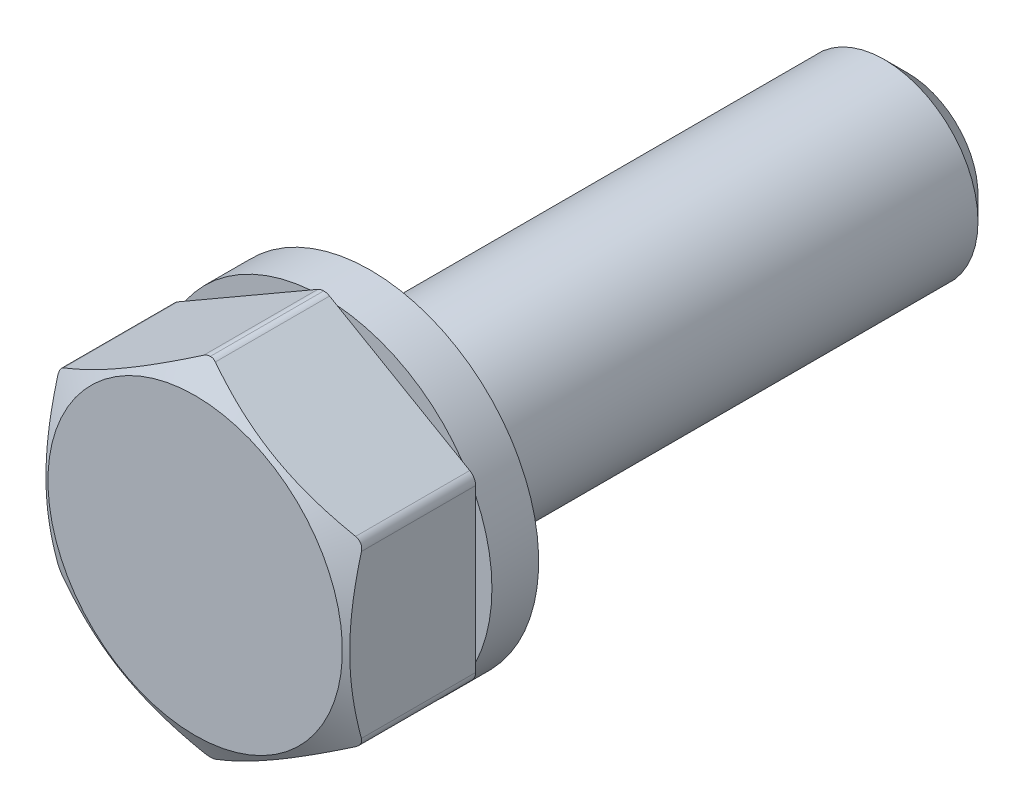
ISO-10303-21;
HEADER;
FILE_DESCRIPTION(('STEP AP214'),'2;1');
FILE_NAME('part.step','',(''),(''),'','','');
FILE_SCHEMA(('AUTOMOTIVE_DESIGN { 1 0 10303 214 1 1 1 1 }'));
ENDSEC;
DATA;
#1=APPLICATION_CONTEXT('core data for automotive mechanical design processes');
#2=APPLICATION_PROTOCOL_DEFINITION('international standard','automotive_design',2000,#1);
#3=PRODUCT_CONTEXT('',#1,'mechanical');
#4=PRODUCT('Part','Part','',(#3));
#5=PRODUCT_RELATED_PRODUCT_CATEGORY('part','',(#4));
#6=PRODUCT_DEFINITION_FORMATION('','',#4);
#7=PRODUCT_DEFINITION_CONTEXT('part definition',#1,'design');
#8=PRODUCT_DEFINITION('design','',#6,#7);
#9=PRODUCT_DEFINITION_SHAPE('','',#8);
#10=(LENGTH_UNIT() NAMED_UNIT(*) SI_UNIT(.MILLI.,.METRE.));
#11=(NAMED_UNIT(*) PLANE_ANGLE_UNIT() SI_UNIT($,.RADIAN.));
#12=(NAMED_UNIT(*) SI_UNIT($,.STERADIAN.) SOLID_ANGLE_UNIT());
#13=UNCERTAINTY_MEASURE_WITH_UNIT(LENGTH_MEASURE(1.E-05),#10,'distance_accuracy_value','');
#14=(GEOMETRIC_REPRESENTATION_CONTEXT(3) GLOBAL_UNCERTAINTY_ASSIGNED_CONTEXT((#13)) GLOBAL_UNIT_ASSIGNED_CONTEXT((#10,
#11,#12)) REPRESENTATION_CONTEXT('',''));
#15=CARTESIAN_POINT('',(0.,0.,0.));
#16=DIRECTION('',(0.,0.,1.));
#17=DIRECTION('',(1.,0.,0.));
#18=AXIS2_PLACEMENT_3D('',#15,#16,#17);
#19=CARTESIAN_POINT('',(0.,-6.92820323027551,2.));
#20=DIRECTION('',(0.,0.,1.));
#21=DIRECTION('',(-1.,0.,0.));
#22=AXIS2_PLACEMENT_3D('',#19,#20,#21);
#23=PLANE('',#22);
#24=CARTESIAN_POINT('',(0.,0.,2.));
#25=DIRECTION('',(0.,0.,1.));
#26=DIRECTION('',(0.,-1.,0.));
#27=AXIS2_PLACEMENT_3D('',#24,#25,#26);
#28=CIRCLE('',#27,7.2);
#29=CARTESIAN_POINT('',(-5.93188366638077,-4.08077886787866,2.));
#30=VERTEX_POINT('',#29);
#31=CARTESIAN_POINT('',(-6.5,-3.0967725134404,2.));
#32=VERTEX_POINT('',#31);
#33=EDGE_CURVE('E22',#30,#32,#28,.F.);
#34=ORIENTED_EDGE('',*,*,#33,.F.);
#35=DIRECTION('',(-0.866025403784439,0.5,0.));
#36=VECTOR('',#35,1.);
#37=CARTESIAN_POINT('',(-0.25,-7.36121593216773,2.));
#38=LINE('',#37,#36);
#39=CARTESIAN_POINT('',(-6.25,-3.89711431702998,2.));
#40=VERTEX_POINT('',#39);
#41=EDGE_CURVE('E168',#30,#40,#38,.T.);
#42=ORIENTED_EDGE('',*,*,#41,.T.);
#43=CARTESIAN_POINT('',(-6.,-3.46410161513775,2.));
#44=DIRECTION('',(0.,0.,-1.));
#45=DIRECTION('',(0.,-1.,0.));
#46=AXIS2_PLACEMENT_3D('',#43,#44,#45);
#47=CIRCLE('',#46,0.5);
#48=CARTESIAN_POINT('',(-6.5,-3.46410161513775,2.));
#49=VERTEX_POINT('',#48);
#50=EDGE_CURVE('E275',#40,#49,#47,.T.);
#51=ORIENTED_EDGE('',*,*,#50,.T.);
#52=DIRECTION('',(0.,1.,0.));
#53=VECTOR('',#52,1.);
#54=CARTESIAN_POINT('',(-6.5,-3.46410161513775,2.));
#55=LINE('',#54,#53);
#56=EDGE_CURVE('E271',#49,#32,#55,.T.);
#57=ORIENTED_EDGE('',*,*,#56,.T.);
#58=EDGE_LOOP('',(#34,#42,#51,#57));
#59=FACE_BOUND('',#58,.T.);
#60=ADVANCED_FACE('F14',(#59),#23,.F.);
#61=CARTESIAN_POINT('',(-6.5,3.0967725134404,2.));
#62=VERTEX_POINT('',#61);
#63=CARTESIAN_POINT('',(-5.93188366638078,4.08077886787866,2.));
#64=VERTEX_POINT('',#63);
#65=EDGE_CURVE('E195',#62,#64,#28,.F.);
#66=ORIENTED_EDGE('',*,*,#65,.F.);
#67=CARTESIAN_POINT('',(-6.5,3.46410161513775,2.));
#68=VERTEX_POINT('',#67);
#69=EDGE_CURVE('E269',#62,#68,#55,.T.);
#70=ORIENTED_EDGE('',*,*,#69,.T.);
#71=CARTESIAN_POINT('',(-6.,3.46410161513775,2.));
#72=DIRECTION('',(0.,0.,-1.));
#73=DIRECTION('',(0.,-1.,0.));
#74=AXIS2_PLACEMENT_3D('',#71,#72,#73);
#75=CIRCLE('',#74,0.5);
#76=CARTESIAN_POINT('',(-6.25,3.89711431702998,2.));
#77=VERTEX_POINT('',#76);
#78=EDGE_CURVE('E265',#68,#77,#75,.T.);
#79=ORIENTED_EDGE('',*,*,#78,.T.);
#80=DIRECTION('',(0.866025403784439,0.5,0.));
#81=VECTOR('',#80,1.);
#82=CARTESIAN_POINT('',(-6.25,3.89711431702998,2.));
#83=LINE('',#82,#81);
#84=EDGE_CURVE('E270',#77,#64,#83,.T.);
#85=ORIENTED_EDGE('',*,*,#84,.T.);
#86=EDGE_LOOP('',(#66,#70,#79,#85));
#87=FACE_BOUND('',#86,.T.);
#88=ADVANCED_FACE('F338',(#87),#23,.F.);
#89=CARTESIAN_POINT('',(-0.568116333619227,7.17755138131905,2.));
#90=VERTEX_POINT('',#89);
#91=CARTESIAN_POINT('',(0.56811633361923,7.17755138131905,2.));
#92=VERTEX_POINT('',#91);
#93=EDGE_CURVE('E198',#90,#92,#28,.F.);
#94=ORIENTED_EDGE('',*,*,#93,.F.);
#95=CARTESIAN_POINT('',(-0.249999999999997,7.36121593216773,2.));
#96=VERTEX_POINT('',#95);
#97=EDGE_CURVE('E285',#90,#96,#83,.T.);
#98=ORIENTED_EDGE('',*,*,#97,.T.);
#99=CARTESIAN_POINT('',(0.,6.92820323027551,2.));
#100=DIRECTION('',(0.,0.,-1.));
#101=DIRECTION('',(0.,1.,0.));
#102=AXIS2_PLACEMENT_3D('',#99,#100,#101);
#103=CIRCLE('',#102,0.5);
#104=CARTESIAN_POINT('',(0.,7.42820323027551,2.));
#105=VERTEX_POINT('',#104);
#106=EDGE_CURVE('E241',#96,#105,#103,.T.);
#107=ORIENTED_EDGE('',*,*,#106,.T.);
#108=CARTESIAN_POINT('',(0.,6.92820323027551,2.));
#109=DIRECTION('',(0.,0.,-1.));
#110=DIRECTION('',(0.,1.,0.));
#111=AXIS2_PLACEMENT_3D('',#108,#109,#110);
#112=CIRCLE('',#111,0.5);
#113=CARTESIAN_POINT('',(0.25,7.36121593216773,2.));
#114=VERTEX_POINT('',#113);
#115=EDGE_CURVE('E238',#105,#114,#112,.T.);
#116=ORIENTED_EDGE('',*,*,#115,.T.);
#117=DIRECTION('',(0.866025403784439,-0.5,0.));
#118=VECTOR('',#117,1.);
#119=CARTESIAN_POINT('',(0.25,7.36121593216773,2.));
#120=LINE('',#119,#118);
#121=EDGE_CURVE('E230',#114,#92,#120,.T.);
#122=ORIENTED_EDGE('',*,*,#121,.T.);
#123=EDGE_LOOP('',(#94,#98,#107,#116,#122));
#124=FACE_BOUND('',#123,.T.);
#125=ADVANCED_FACE('F345',(#124),#23,.F.);
#126=CARTESIAN_POINT('',(5.93188366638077,4.08077886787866,2.));
#127=VERTEX_POINT('',#126);
#128=CARTESIAN_POINT('',(6.5,3.0967725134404,2.));
#129=VERTEX_POINT('',#128);
#130=EDGE_CURVE('E191',#127,#129,#28,.F.);
#131=ORIENTED_EDGE('',*,*,#130,.F.);
#132=CARTESIAN_POINT('',(6.25,3.89711431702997,2.));
#133=VERTEX_POINT('',#132);
#134=EDGE_CURVE('E212',#127,#133,#120,.T.);
#135=ORIENTED_EDGE('',*,*,#134,.T.);
#136=CARTESIAN_POINT('',(6.,3.46410161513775,2.));
#137=DIRECTION('',(0.,0.,-1.));
#138=DIRECTION('',(0.,-1.,0.));
#139=AXIS2_PLACEMENT_3D('',#136,#137,#138);
#140=CIRCLE('',#139,0.5);
#141=CARTESIAN_POINT('',(6.5,3.46410161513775,2.));
#142=VERTEX_POINT('',#141);
#143=EDGE_CURVE('E228',#133,#142,#140,.T.);
#144=ORIENTED_EDGE('',*,*,#143,.T.);
#145=DIRECTION('',(0.,-1.,0.));
#146=VECTOR('',#145,1.);
#147=CARTESIAN_POINT('',(6.5,3.46410161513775,2.));
#148=LINE('',#147,#146);
#149=EDGE_CURVE('E215',#142,#129,#148,.T.);
#150=ORIENTED_EDGE('',*,*,#149,.T.);
#151=EDGE_LOOP('',(#131,#135,#144,#150));
#152=FACE_BOUND('',#151,.T.);
#153=ADVANCED_FACE('F210',(#152),#23,.F.);
#154=CARTESIAN_POINT('',(6.5,-3.0967725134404,2.));
#155=VERTEX_POINT('',#154);
#156=CARTESIAN_POINT('',(5.93188366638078,-4.08077886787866,2.));
#157=VERTEX_POINT('',#156);
#158=EDGE_CURVE('E189',#155,#157,#28,.F.);
#159=ORIENTED_EDGE('',*,*,#158,.F.);
#160=CARTESIAN_POINT('',(6.5,-3.46410161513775,2.));
#161=VERTEX_POINT('',#160);
#162=EDGE_CURVE('E280',#155,#161,#148,.T.);
#163=ORIENTED_EDGE('',*,*,#162,.T.);
#164=CARTESIAN_POINT('',(6.,-3.46410161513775,2.));
#165=DIRECTION('',(0.,0.,-1.));
#166=DIRECTION('',(0.,-1.,0.));
#167=AXIS2_PLACEMENT_3D('',#164,#165,#166);
#168=CIRCLE('',#167,0.5);
#169=CARTESIAN_POINT('',(6.25,-3.89711431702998,2.));
#170=VERTEX_POINT('',#169);
#171=EDGE_CURVE('E314',#161,#170,#168,.T.);
#172=ORIENTED_EDGE('',*,*,#171,.T.);
#173=DIRECTION('',(-0.866025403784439,-0.5,0.));
#174=VECTOR('',#173,1.);
#175=CARTESIAN_POINT('',(6.25,-3.89711431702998,2.));
#176=LINE('',#175,#174);
#177=EDGE_CURVE('E318',#170,#157,#176,.T.);
#178=ORIENTED_EDGE('',*,*,#177,.T.);
#179=EDGE_LOOP('',(#159,#163,#172,#178));
#180=FACE_BOUND('',#179,.T.);
#181=ADVANCED_FACE('F351',(#180),#23,.F.);
#182=CARTESIAN_POINT('',(0.,6.92820323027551,7.5));
#183=DIRECTION('',(0.,0.,-1.));
#184=DIRECTION('',(0.,1.,0.));
#185=AXIS2_PLACEMENT_3D('',#182,#183,#184);
#186=CYLINDRICAL_SURFACE('',#185,0.5);
#187=DIRECTION('',(0.,0.,-1.));
#188=VECTOR('',#187,1.);
#189=CARTESIAN_POINT('',(-0.249999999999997,7.36121593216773,7.5));
#190=LINE('',#189,#188);
#191=CARTESIAN_POINT('',(-0.249999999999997,7.36121593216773,6.88485642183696));
#192=VERTEX_POINT('',#191);
#193=EDGE_CURVE('E259',#192,#96,#190,.T.);
#194=ORIENTED_EDGE('',*,*,#193,.F.);
#195=CARTESIAN_POINT('',(-0.250199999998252,7.36110040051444,6.88491916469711));
#196=CARTESIAN_POINT('',(-0.228543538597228,7.37365394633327,6.87810237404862));
#197=CARTESIAN_POINT('',(-0.205681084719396,7.38466007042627,6.87214077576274));
#198=CARTESIAN_POINT('',(-0.158776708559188,7.40296671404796,6.86223970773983));
#199=CARTESIAN_POINT('',(-0.134776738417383,7.41035049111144,6.85825477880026));
#200=CARTESIAN_POINT('',(-0.0923872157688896,7.41993602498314,6.8530851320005));
#201=CARTESIAN_POINT('',(-0.0742464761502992,7.42300088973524,6.85143364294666));
#202=CARTESIAN_POINT('',(-0.0373436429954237,7.4271599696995,6.84919332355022));
#203=CARTESIAN_POINT('',(-0.0185762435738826,7.42821766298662,6.84862418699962));
#204=CARTESIAN_POINT('',(0.000200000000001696,7.42820319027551,6.84863158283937));
#205=B_SPLINE_CURVE_WITH_KNOTS('',3,(#195,#196,#197,#198,#199,#200,#201,#202,#203,#204),
.UNSPECIFIED.,.F.,.F.,(4,2,2,2,4),(0.,0.0778021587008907,0.153720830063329,0.208997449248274,
0.265270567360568),.UNSPECIFIED.);
#206=CARTESIAN_POINT('',(0.,7.42820323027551,6.84863156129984));
#207=VERTEX_POINT('',#206);
#208=EDGE_CURVE('E765',#192,#207,#205,.T.);
#209=ORIENTED_EDGE('',*,*,#208,.T.);
#210=DIRECTION('',(0.,0.,-1.));
#211=VECTOR('',#210,1.);
#212=CARTESIAN_POINT('',(0.,7.42820323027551,7.5));
#213=LINE('',#212,#211);
#214=EDGE_CURVE('E256',#207,#105,#213,.T.);
#215=ORIENTED_EDGE('',*,*,#214,.T.);
#216=ORIENTED_EDGE('',*,*,#106,.F.);
#217=EDGE_LOOP('',(#194,#209,#215,#216));
#218=FACE_BOUND('',#217,.T.);
#219=ADVANCED_FACE('F363',(#218),#186,.T.);
#220=CARTESIAN_POINT('',(0.,-6.92820323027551,7.5));
#221=DIRECTION('',(0.,0.,-1.));
#222=DIRECTION('',(0.,1.,0.));
#223=AXIS2_PLACEMENT_3D('',#220,#221,#222);
#224=CYLINDRICAL_SURFACE('',#223,0.5);
#225=DIRECTION('',(0.,0.,-1.));
#226=VECTOR('',#225,1.);
#227=CARTESIAN_POINT('',(0.25,-7.36121593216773,7.5));
#228=LINE('',#227,#226);
#229=CARTESIAN_POINT('',(0.25,-7.36121593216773,6.88485642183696));
#230=VERTEX_POINT('',#229);
#231=CARTESIAN_POINT('',(0.25,-7.36121593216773,2.));
#232=VERTEX_POINT('',#231);
#233=EDGE_CURVE('E243',#230,#232,#228,.T.);
#234=ORIENTED_EDGE('',*,*,#233,.F.);
#235=CARTESIAN_POINT('',(0.250199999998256,-7.36110040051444,6.88491916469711));
#236=CARTESIAN_POINT('',(0.228805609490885,-7.37349856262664,6.87818675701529));
#237=CARTESIAN_POINT('',(0.206246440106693,-7.38438605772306,6.87228919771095));
#238=CARTESIAN_POINT('',(0.159385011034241,-7.40278010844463,6.86234040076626));
#239=CARTESIAN_POINT('',(0.135081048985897,-7.41028330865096,6.85829099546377));
#240=CARTESIAN_POINT('',(0.0853049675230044,-7.4215358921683,6.85222231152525));
#241=CARTESIAN_POINT('',(0.0598303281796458,-7.42527673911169,6.85020764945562));
#242=CARTESIAN_POINT('',(0.00855431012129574,-7.42878875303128,6.84831614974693));
#243=CARTESIAN_POINT('',(-0.0172467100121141,-7.42856395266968,6.84843714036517));
#244=CARTESIAN_POINT('',(-0.0675781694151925,-7.42423870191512,6.85076680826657));
#245=CARTESIAN_POINT('',(-0.0921227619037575,-7.42026335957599,6.85290809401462));
#246=CARTESIAN_POINT('',(-0.140133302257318,-7.40879777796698,6.85909282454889));
#247=CARTESIAN_POINT('',(-0.163599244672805,-7.40130752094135,6.863136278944));
#248=CARTESIAN_POINT('',(-0.19733314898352,-7.38777242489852,6.87045794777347));
#249=CARTESIAN_POINT('',(-0.208246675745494,-7.38292818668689,6.87308039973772));
#250=CARTESIAN_POINT('',(-0.229588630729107,-7.37253347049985,6.87871365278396));
#251=CARTESIAN_POINT('',(-0.240018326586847,-7.36698499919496,6.88172335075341));
#252=CARTESIAN_POINT('',(-0.250199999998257,-7.36110040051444,6.88491916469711));
#253=B_SPLINE_CURVE_WITH_KNOTS('',3,(#235,#236,#237,#238,#239,#240,#241,#242,#243,#244,#245,
#246,#247,#248,#249,#250,#251,#252),.UNSPECIFIED.,.F.,.F.,(4,2,2,2,2,2,2,2,4),(0.,
0.0768357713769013,0.153747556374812,0.230833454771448,0.307840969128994,0.382367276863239,
0.456893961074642,0.493538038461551,0.530079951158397),.UNSPECIFIED.);
#254=CARTESIAN_POINT('',(-0.25,-7.36121593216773,6.88485642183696));
#255=VERTEX_POINT('',#254);
#256=EDGE_CURVE('E758',#230,#255,#253,.T.);
#257=ORIENTED_EDGE('',*,*,#256,.T.);
#258=DIRECTION('',(0.,0.,-1.));
#259=VECTOR('',#258,1.);
#260=CARTESIAN_POINT('',(-0.25,-7.36121593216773,7.5));
#261=LINE('',#260,#259);
#262=CARTESIAN_POINT('',(-0.25,-7.36121593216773,2.));
#263=VERTEX_POINT('',#262);
#264=EDGE_CURVE('E247',#255,#263,#261,.T.);
#265=ORIENTED_EDGE('',*,*,#264,.T.);
#266=CARTESIAN_POINT('',(0.,-6.92820323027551,2.));
#267=DIRECTION('',(0.,0.,-1.));
#268=DIRECTION('',(0.,-1.,0.));
#269=AXIS2_PLACEMENT_3D('',#266,#267,#268);
#270=CIRCLE('',#269,0.5);
#271=EDGE_CURVE('E162',#232,#263,#270,.T.);
#272=ORIENTED_EDGE('',*,*,#271,.F.);
#273=EDGE_LOOP('',(#234,#257,#265,#272));
#274=FACE_BOUND('',#273,.T.);
#275=ADVANCED_FACE('F370',(#274),#224,.T.);
#276=CARTESIAN_POINT('',(6.25,-3.89711431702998,7.5));
#277=DIRECTION('',(0.5,-0.866025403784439,0.));
#278=DIRECTION('',(0.,0.,-1.));
#279=AXIS2_PLACEMENT_3D('',#276,#277,#278);
#280=PLANE('',#279);
#281=DIRECTION('',(0.,0.,-1.));
#282=VECTOR('',#281,1.);
#283=CARTESIAN_POINT('',(6.25,-3.89711431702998,7.5));
#284=LINE('',#283,#282);
#285=CARTESIAN_POINT('',(6.25,-3.89711431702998,6.88485642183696));
#286=VERTEX_POINT('',#285);
#287=EDGE_CURVE('E248',#286,#170,#284,.T.);
#288=ORIENTED_EDGE('',*,*,#287,.F.);
#289=CARTESIAN_POINT('',(6.2502,-3.89699884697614,6.88479371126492));
#290=CARTESIAN_POINT('',(6.10935352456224,-3.97831659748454,6.92895001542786));
#291=CARTESIAN_POINT('',(5.96798656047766,-4.05993485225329,6.97086073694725));
#292=CARTESIAN_POINT('',(5.68415119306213,-4.22380727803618,7.04960828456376));
#293=CARTESIAN_POINT('',(5.54168244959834,-4.30606164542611,7.08644347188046));
#294=CARTESIAN_POINT('',(5.11219808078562,-4.55402456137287,7.18853231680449));
#295=CARTESIAN_POINT('',(4.82356861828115,-4.72066485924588,7.2452196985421));
#296=CARTESIAN_POINT('',(4.39169797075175,-4.97000549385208,7.30923511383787));
#297=CARTESIAN_POINT('',(4.24957447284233,-5.05206053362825,7.32698098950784));
#298=CARTESIAN_POINT('',(3.96481200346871,-5.21646822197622,7.35555697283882));
#299=CARTESIAN_POINT('',(3.82217309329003,-5.29882083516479,7.36638787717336));
#300=CARTESIAN_POINT('',(3.53675560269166,-5.46360670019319,7.38086037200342));
#301=CARTESIAN_POINT('',(3.39397728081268,-5.54603980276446,7.38450873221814));
#302=CARTESIAN_POINT('',(3.10843035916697,-5.71090039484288,7.38455098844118));
#303=CARTESIAN_POINT('',(2.96566175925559,-5.79332788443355,7.38094521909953));
#304=CARTESIAN_POINT('',(2.6074016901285,-6.00016943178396,7.36287303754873));
#305=CARTESIAN_POINT('',(2.39207509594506,-6.12448829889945,7.34379383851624));
#306=CARTESIAN_POINT('',(1.96277674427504,-6.3723438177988,7.29023608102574));
#307=CARTESIAN_POINT('',(1.74880579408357,-6.49588000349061,7.25574908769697));
#308=CARTESIAN_POINT('',(1.31910945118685,-6.74396530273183,7.17230265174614));
#309=CARTESIAN_POINT('',(1.10342062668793,-6.86849330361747,7.12309652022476));
#310=CARTESIAN_POINT('',(0.674659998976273,-7.11603836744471,7.01254279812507));
#311=CARTESIAN_POINT('',(0.461585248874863,-7.23905713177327,6.95121053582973));
#312=CARTESIAN_POINT('',(0.2498,-7.36133140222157,6.88479371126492));
#313=B_SPLINE_CURVE_WITH_KNOTS('',3,(#289,#290,#291,#292,#293,#294,#295,#296,#297,#298,#299,
#300,#301,#302,#303,#304,#305,#306,#307,#308,#309,#310,#311,#312),.UNSPECIFIED.,.F.,.F.,(4,2,2,
2,2,2,2,2,2,2,2,4),(0.,0.505527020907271,1.01121688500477,2.02426346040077,2.51934622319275,
3.01437193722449,3.50893085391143,4.00346695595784,4.75102402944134,5.49899084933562,
6.26027182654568,7.02059657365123),.UNSPECIFIED.);
#314=EDGE_CURVE('E306',#286,#230,#313,.T.);
#315=ORIENTED_EDGE('',*,*,#314,.T.);
#316=ORIENTED_EDGE('',*,*,#233,.T.);
#317=CARTESIAN_POINT('',(0.568116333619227,-7.17755138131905,2.));
#318=VERTEX_POINT('',#317);
#319=EDGE_CURVE('E309',#318,#232,#176,.T.);
#320=ORIENTED_EDGE('',*,*,#319,.F.);
#321=EDGE_CURVE('E36',#157,#318,#176,.T.);
#322=ORIENTED_EDGE('',*,*,#321,.F.);
#323=ORIENTED_EDGE('',*,*,#177,.F.);
#324=EDGE_LOOP('',(#288,#315,#316,#320,#322,#323));
#325=FACE_BOUND('',#324,.T.);
#326=ADVANCED_FACE('F472',(#325),#280,.T.);
#327=CARTESIAN_POINT('',(6.,-3.46410161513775,7.5));
#328=DIRECTION('',(0.,0.,-1.));
#329=DIRECTION('',(0.,1.,0.));
#330=AXIS2_PLACEMENT_3D('',#327,#328,#329);
#331=CYLINDRICAL_SURFACE('',#330,0.5);
#332=DIRECTION('',(0.,0.,-1.));
#333=VECTOR('',#332,1.);
#334=CARTESIAN_POINT('',(6.5,-3.46410161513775,7.5));
#335=LINE('',#334,#333);
#336=CARTESIAN_POINT('',(6.5,-3.46410161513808,6.8848564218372));
#337=VERTEX_POINT('',#336);
#338=EDGE_CURVE('E249',#337,#161,#335,.T.);
#339=ORIENTED_EDGE('',*,*,#338,.F.);
#340=CARTESIAN_POINT('',(6.49999996,-3.46390161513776,6.88491074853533));
#341=CARTESIAN_POINT('',(6.50003835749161,-3.48862867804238,6.87817910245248));
#342=CARTESIAN_POINT('',(6.49818608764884,-3.513608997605,6.87228233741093));
#343=CARTESIAN_POINT('',(6.49068209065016,-3.56338843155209,6.8623351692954));
#344=CARTESIAN_POINT('',(6.48502660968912,-3.58818734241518,6.85828659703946));
#345=CARTESIAN_POINT('',(6.46988080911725,-3.63691962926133,6.85221958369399));
#346=CARTESIAN_POINT('',(6.46038183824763,-3.66085091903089,6.85020575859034));
#347=CARTESIAN_POINT('',(6.43778289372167,-3.70701140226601,6.84831589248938));
#348=CARTESIAN_POINT('',(6.4246865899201,-3.72924230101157,6.84843768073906));
#349=CARTESIAN_POINT('',(6.39577302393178,-3.77066597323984,6.85076885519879));
#350=CARTESIAN_POINT('',(6.38005699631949,-3.78993354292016,6.85291087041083));
#351=CARTESIAN_POINT('',(6.3461205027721,-3.82577695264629,6.85909699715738));
#352=CARTESIAN_POINT('',(6.32790002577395,-3.84235278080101,6.86314111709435));
#353=CARTESIAN_POINT('',(6.29931392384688,-3.86479511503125,6.87046281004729));
#354=CARTESIAN_POINT('',(6.28966534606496,-3.8718213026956,6.87308449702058));
#355=CARTESIAN_POINT('',(6.26999942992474,-3.8851010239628,6.87871591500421));
#356=CARTESIAN_POINT('',(6.25998319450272,-3.89135665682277,6.8817245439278));
#357=CARTESIAN_POINT('',(6.2498,-3.8972297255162,6.88491914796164));
#358=B_SPLINE_CURVE_WITH_KNOTS('',3,(#340,#341,#342,#343,#344,#345,#346,#347,#348,#349,#350,
#351,#352,#353,#354,#355,#356,#357),.UNSPECIFIED.,.F.,.F.,(4,2,2,2,2,2,2,2,4),(0.,
0.07683485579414,0.153745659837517,0.230830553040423,0.307837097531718,0.382363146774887,
0.456889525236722,0.493519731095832,0.530047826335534),.UNSPECIFIED.);
#359=EDGE_CURVE('E797',#337,#286,#358,.T.);
#360=ORIENTED_EDGE('',*,*,#359,.T.);
#361=ORIENTED_EDGE('',*,*,#287,.T.);
#362=ORIENTED_EDGE('',*,*,#171,.F.);
#363=EDGE_LOOP('',(#339,#360,#361,#362));
#364=FACE_BOUND('',#363,.T.);
#365=ADVANCED_FACE('F483',(#364),#331,.T.);
#366=CARTESIAN_POINT('',(6.5,3.46410161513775,7.5));
#367=DIRECTION('',(1.,0.,0.));
#368=DIRECTION('',(0.,1.,0.));
#369=AXIS2_PLACEMENT_3D('',#366,#367,#368);
#370=PLANE('',#369);
#371=DIRECTION('',(0.,0.,-1.));
#372=VECTOR('',#371,1.);
#373=CARTESIAN_POINT('',(6.5,3.46410161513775,7.5));
#374=LINE('',#373,#372);
#375=CARTESIAN_POINT('',(6.5,3.46410161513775,6.88485642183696));
#376=VERTEX_POINT('',#375);
#377=EDGE_CURVE('E253',#376,#142,#374,.T.);
#378=ORIENTED_EDGE('',*,*,#377,.F.);
#379=CARTESIAN_POINT('',(6.5,-9.87937316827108,4.30961762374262));
#380=CARTESIAN_POINT('',(6.5,-9.59455112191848,4.44695218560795));
#381=CARTESIAN_POINT('',(6.5,-9.30904728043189,4.58289879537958));
#382=CARTESIAN_POINT('',(6.5,-8.7363069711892,4.85122122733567));
#383=CARTESIAN_POINT('',(6.5,-8.44907020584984,4.98359641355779));
#384=CARTESIAN_POINT('',(6.5,-7.87090669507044,5.24469463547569));
#385=CARTESIAN_POINT('',(6.5,-7.57996819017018,5.37339172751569));
#386=CARTESIAN_POINT('',(6.5,-6.99567261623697,5.62515105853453));
#387=CARTESIAN_POINT('',(6.5,-6.70231567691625,5.74821359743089));
#388=CARTESIAN_POINT('',(6.5,-6.10941976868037,5.98852272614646));
#389=CARTESIAN_POINT('',(6.5,-5.80984832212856,6.10568963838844));
#390=CARTESIAN_POINT('',(6.5,-5.20714673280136,6.33066205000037));
#391=CARTESIAN_POINT('',(6.5,-4.90401619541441,6.43846649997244));
#392=CARTESIAN_POINT('',(6.5,-4.29435799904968,6.64176296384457));
#393=CARTESIAN_POINT('',(6.5,-3.9878393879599,6.73728181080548));
#394=CARTESIAN_POINT('',(6.5,-3.37045988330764,6.91285926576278));
#395=CARTESIAN_POINT('',(6.5,-3.05960041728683,6.99292283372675));
#396=CARTESIAN_POINT('',(6.5,-2.43324585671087,7.13365684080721));
#397=CARTESIAN_POINT('',(6.5,-2.11774866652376,7.19431821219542));
#398=CARTESIAN_POINT('',(6.5,-1.64178994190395,7.26767982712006));
#399=CARTESIAN_POINT('',(6.5,-1.48266496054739,7.28919686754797));
#400=CARTESIAN_POINT('',(6.5,-1.16369504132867,7.32592956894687));
#401=CARTESIAN_POINT('',(6.5,-1.0038501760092,7.34114585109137));
#402=CARTESIAN_POINT('',(6.5,-0.684627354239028,7.36487111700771));
#403=CARTESIAN_POINT('',(6.5,-0.525252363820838,7.37341985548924));
#404=CARTESIAN_POINT('',(6.5,-0.206284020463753,7.38376610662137));
#405=CARTESIAN_POINT('',(6.5,-0.0466906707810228,7.38556371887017));
#406=CARTESIAN_POINT('',(6.5,0.272385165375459,7.38236514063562));
#407=CARTESIAN_POINT('',(6.5,0.431867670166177,7.3773707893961));
#408=CARTESIAN_POINT('',(6.5,0.750486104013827,7.36071023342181));
#409=CARTESIAN_POINT('',(6.5,0.90962201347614,7.34904366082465));
#410=CARTESIAN_POINT('',(6.5,1.29759215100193,7.31270747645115));
#411=CARTESIAN_POINT('',(6.5,1.52610755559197,7.28456838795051));
#412=CARTESIAN_POINT('',(6.5,1.98129829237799,7.21611644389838));
#413=CARTESIAN_POINT('',(6.5,2.20797333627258,7.17580171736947));
#414=CARTESIAN_POINT('',(6.5,2.88565812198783,7.03862194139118));
#415=CARTESIAN_POINT('',(6.5,3.3334356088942,6.92561532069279));
#416=CARTESIAN_POINT('',(6.5,4.00309005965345,6.73138861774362));
#417=CARTESIAN_POINT('',(6.5,4.22848110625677,6.66160195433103));
#418=CARTESIAN_POINT('',(6.5,4.67708584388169,6.51522557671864));
#419=CARTESIAN_POINT('',(6.5,4.90029933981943,6.43863525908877));
#420=CARTESIAN_POINT('',(6.5,5.34343286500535,6.28028089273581));
#421=CARTESIAN_POINT('',(6.5,5.56336440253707,6.19854872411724));
#422=CARTESIAN_POINT('',(6.5,6.00136716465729,6.03045176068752));
#423=CARTESIAN_POINT('',(6.5,6.21943899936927,5.94408855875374));
#424=CARTESIAN_POINT('',(6.5,6.43672965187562,5.8558457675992));
#425=B_SPLINE_CURVE_WITH_KNOTS('',3,(#379,#380,#381,#382,#383,#384,#385,#386,#387,#388,#389,
#390,#391,#392,#393,#394,#395,#396,#397,#398,#399,#400,#401,#402,#403,#404,#405,#406,#407,#408,
#409,#410,#411,#412,#413,#414,#415,#416,#417,#418,#419,#420,#421,#422,#423,#424),.UNSPECIFIED.,
.F.,.F.,(4,2,2,2,2,2,2,2,2,2,2,2,2,2,2,2,2,2,2,2,2,2,4),(0.,0.948622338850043,1.89741249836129,
2.85176190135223,3.80606044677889,4.77094701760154,5.73594159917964,6.69879138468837,
7.66133165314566,8.62432111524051,9.1059354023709,9.58750219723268,10.0661752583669,
10.5448412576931,11.0233776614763,11.5019404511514,12.1922707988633,12.882707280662,
14.266258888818,14.9740490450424,15.6819020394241,16.3857318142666,17.089321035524),.UNSPECIFIED.);
#426=EDGE_CURVE('E791',#376,#337,#425,.F.);
#427=ORIENTED_EDGE('',*,*,#426,.T.);
#428=ORIENTED_EDGE('',*,*,#338,.T.);
#429=ORIENTED_EDGE('',*,*,#162,.F.);
#430=EDGE_CURVE('E279',#129,#155,#148,.T.);
#431=ORIENTED_EDGE('',*,*,#430,.F.);
#432=ORIENTED_EDGE('',*,*,#149,.F.);
#433=EDGE_LOOP('',(#378,#427,#428,#429,#431,#432));
#434=FACE_BOUND('',#433,.T.);
#435=ADVANCED_FACE('F377',(#434),#370,.T.);
#436=CARTESIAN_POINT('',(6.,3.46410161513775,7.5));
#437=DIRECTION('',(0.,0.,-1.));
#438=DIRECTION('',(0.,1.,0.));
#439=AXIS2_PLACEMENT_3D('',#436,#437,#438);
#440=CYLINDRICAL_SURFACE('',#439,0.5);
#441=DIRECTION('',(0.,0.,-1.));
#442=VECTOR('',#441,1.);
#443=CARTESIAN_POINT('',(6.25,3.89711431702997,7.5));
#444=LINE('',#443,#442);
#445=CARTESIAN_POINT('',(6.25,3.89711431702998,6.88485642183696));
#446=VERTEX_POINT('',#445);
#447=EDGE_CURVE('E225',#446,#133,#444,.T.);
#448=ORIENTED_EDGE('',*,*,#447,.F.);
#449=CARTESIAN_POINT('',(6.2498,3.8972297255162,6.88491914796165));
#450=CARTESIAN_POINT('',(6.27123431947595,3.8849007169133,6.87818674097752));
#451=CARTESIAN_POINT('',(6.29194275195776,3.87080764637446,6.87228918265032));
#452=CARTESIAN_POINT('',(6.33130317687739,3.83942147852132,6.86234038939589));
#453=CARTESIAN_POINT('',(6.3499531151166,3.82212522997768,6.8582909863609));
#454=CARTESIAN_POINT('',(6.38458616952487,3.7846441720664,6.85222230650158));
#455=CARTESIAN_POINT('',(6.40056315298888,3.76445291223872,6.8502076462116));
#456=CARTESIAN_POINT('',(6.4292426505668,3.72180258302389,6.84831614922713));
#457=CARTESIAN_POINT('',(6.44194847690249,3.69934583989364,6.84843714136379));
#458=CARTESIAN_POINT('',(6.4633684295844,3.65359487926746,6.85076681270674));
#459=CARTESIAN_POINT('',(6.47219797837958,3.6303509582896,6.85290810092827));
#460=CARTESIAN_POINT('',(6.48627375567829,3.58303981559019,6.85909283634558));
#461=CARTESIAN_POINT('',(6.49151996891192,3.55897259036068,6.86313629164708));
#462=CARTESIAN_POINT('',(6.49666443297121,3.52299585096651,6.87045689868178));
#463=CARTESIAN_POINT('',(6.49792559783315,3.51112756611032,6.87307810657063));
#464=CARTESIAN_POINT('',(6.49959449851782,3.48745790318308,6.8787085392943));
#465=CARTESIAN_POINT('',(6.50000460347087,3.47565643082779,6.88171666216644));
#466=CARTESIAN_POINT('',(6.49999996,3.46390161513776,6.88491074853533));
#467=B_SPLINE_CURVE_WITH_KNOTS('',3,(#449,#450,#451,#452,#453,#454,#455,#456,#457,#458,#459,
#460,#461,#462,#463,#464,#465,#466),.UNSPECIFIED.,.F.,.F.,(4,2,2,2,2,2,2,2,4),(0.,
0.0768357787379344,0.153747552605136,0.230833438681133,0.307840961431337,0.382367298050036,
0.456893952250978,0.493521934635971,0.530047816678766),.UNSPECIFIED.);
#468=EDGE_CURVE('E785',#446,#376,#467,.T.);
#469=ORIENTED_EDGE('',*,*,#468,.T.);
#470=ORIENTED_EDGE('',*,*,#377,.T.);
#471=ORIENTED_EDGE('',*,*,#143,.F.);
#472=EDGE_LOOP('',(#448,#469,#470,#471));
#473=FACE_BOUND('',#472,.T.);
#474=ADVANCED_FACE('F502',(#473),#440,.T.);
#475=CARTESIAN_POINT('',(0.25,7.36121593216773,7.5));
#476=DIRECTION('',(0.5,0.866025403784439,0.));
#477=DIRECTION('',(0.,0.,1.));
#478=AXIS2_PLACEMENT_3D('',#475,#476,#477);
#479=PLANE('',#478);
#480=DIRECTION('',(0.,0.,-1.));
#481=VECTOR('',#480,1.);
#482=CARTESIAN_POINT('',(0.25,7.36121593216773,7.5));
#483=LINE('',#482,#481);
#484=CARTESIAN_POINT('',(0.25,7.36121593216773,6.88485642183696));
#485=VERTEX_POINT('',#484);
#486=EDGE_CURVE('E263',#485,#114,#483,.T.);
#487=ORIENTED_EDGE('',*,*,#486,.F.);
#488=CARTESIAN_POINT('',(0.2498,7.36133140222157,6.88479371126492));
#489=CARTESIAN_POINT('',(0.390646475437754,7.28001365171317,6.92895001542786));
#490=CARTESIAN_POINT('',(0.532013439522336,7.19839539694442,6.97086073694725));
#491=CARTESIAN_POINT('',(0.81584880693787,7.03452297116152,7.04960828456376));
#492=CARTESIAN_POINT('',(0.95831755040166,6.9522686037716,7.08644347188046));
#493=CARTESIAN_POINT('',(1.38780191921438,6.70430568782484,7.18853231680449));
#494=CARTESIAN_POINT('',(1.67643138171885,6.53766538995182,7.2452196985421));
#495=CARTESIAN_POINT('',(2.10830202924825,6.28832475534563,7.30923511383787));
#496=CARTESIAN_POINT('',(2.25042552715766,6.20626971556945,7.32698098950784));
#497=CARTESIAN_POINT('',(2.53518799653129,6.04186202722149,7.35555697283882));
#498=CARTESIAN_POINT('',(2.67782690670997,5.95950941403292,7.36638787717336));
#499=CARTESIAN_POINT('',(2.96324439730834,5.79472354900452,7.38086037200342));
#500=CARTESIAN_POINT('',(3.10602271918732,5.71229044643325,7.38450873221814));
#501=CARTESIAN_POINT('',(3.39156964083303,5.54742985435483,7.38455098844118));
#502=CARTESIAN_POINT('',(3.53433824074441,5.46500236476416,7.38094521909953));
#503=CARTESIAN_POINT('',(3.8925983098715,5.25816081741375,7.36287303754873));
#504=CARTESIAN_POINT('',(4.10792490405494,5.13384195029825,7.34379383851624));
#505=CARTESIAN_POINT('',(4.53722325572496,4.8859864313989,7.29023608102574));
#506=CARTESIAN_POINT('',(4.75119420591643,4.7624502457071,7.25574908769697));
#507=CARTESIAN_POINT('',(5.18089054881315,4.51436494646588,7.17230265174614));
#508=CARTESIAN_POINT('',(5.39657937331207,4.38983694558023,7.12309652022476));
#509=CARTESIAN_POINT('',(5.82534000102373,4.14229188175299,7.01254279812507));
#510=CARTESIAN_POINT('',(6.03841475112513,4.01927311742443,6.95121053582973));
#511=CARTESIAN_POINT('',(6.2502,3.89699884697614,6.88479371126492));
#512=B_SPLINE_CURVE_WITH_KNOTS('',3,(#488,#489,#490,#491,#492,#493,#494,#495,#496,#497,#498,
#499,#500,#501,#502,#503,#504,#505,#506,#507,#508,#509,#510,#511),.UNSPECIFIED.,.F.,.F.,(4,2,2,
2,2,2,2,2,2,2,2,4),(0.,0.505527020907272,1.01121688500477,2.02426346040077,2.51934622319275,
3.01437193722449,3.50893085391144,4.00346695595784,4.75102402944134,5.49899084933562,
6.26027182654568,7.02059657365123),.UNSPECIFIED.);
#513=EDGE_CURVE('E778',#485,#446,#512,.T.);
#514=ORIENTED_EDGE('',*,*,#513,.T.);
#515=ORIENTED_EDGE('',*,*,#447,.T.);
#516=ORIENTED_EDGE('',*,*,#134,.F.);
#517=EDGE_CURVE('E221',#92,#127,#120,.T.);
#518=ORIENTED_EDGE('',*,*,#517,.F.);
#519=ORIENTED_EDGE('',*,*,#121,.F.);
#520=EDGE_LOOP('',(#487,#514,#515,#516,#518,#519));
#521=FACE_BOUND('',#520,.T.);
#522=ADVANCED_FACE('F219',(#521),#479,.T.);
#523=CARTESIAN_POINT('',(0.,6.92820323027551,7.5));
#524=DIRECTION('',(0.,0.,-1.));
#525=DIRECTION('',(0.,1.,0.));
#526=AXIS2_PLACEMENT_3D('',#523,#524,#525);
#527=CYLINDRICAL_SURFACE('',#526,0.5);
#528=ORIENTED_EDGE('',*,*,#214,.F.);
#529=CARTESIAN_POINT('',(-0.000199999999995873,7.42820319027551,6.84863158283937));
#530=CARTESIAN_POINT('',(0.0257483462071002,7.42824939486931,6.84860823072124));
#531=CARTESIAN_POINT('',(0.051681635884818,7.42620622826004,6.84970690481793));
#532=CARTESIAN_POINT('',(0.102147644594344,7.41829810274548,6.8539677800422));
#533=CARTESIAN_POINT('',(0.126699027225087,7.41252573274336,6.85707999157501));
#534=CARTESIAN_POINT('',(0.167901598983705,7.39952419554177,6.86410184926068));
#535=CARTESIAN_POINT('',(0.184893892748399,7.39311100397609,6.86756831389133));
#536=CARTESIAN_POINT('',(0.218203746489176,7.37845249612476,6.87550407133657));
#537=CARTESIAN_POINT('',(0.234503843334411,7.37017651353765,6.87999016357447));
#538=CARTESIAN_POINT('',(0.250199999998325,7.36110040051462,6.88491916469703));
#539=B_SPLINE_CURVE_WITH_KNOTS('',3,(#529,#530,#531,#532,#533,#534,#535,#536,#537,#538),
.UNSPECIFIED.,.F.,.F.,(4,2,2,2,4),(0.,0.0777193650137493,0.153579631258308,0.208927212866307,
0.265262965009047),.UNSPECIFIED.);
#540=EDGE_CURVE('E697',#207,#485,#539,.T.);
#541=ORIENTED_EDGE('',*,*,#540,.T.);
#542=ORIENTED_EDGE('',*,*,#486,.T.);
#543=ORIENTED_EDGE('',*,*,#115,.F.);
#544=EDGE_LOOP('',(#528,#541,#542,#543));
#545=FACE_BOUND('',#544,.T.);
#546=ADVANCED_FACE('F522',(#545),#527,.T.);
#547=CARTESIAN_POINT('',(-6.25,3.89711431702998,7.5));
#548=DIRECTION('',(-0.5,0.866025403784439,0.));
#549=DIRECTION('',(0.,0.,1.));
#550=AXIS2_PLACEMENT_3D('',#547,#548,#549);
#551=PLANE('',#550);
#552=DIRECTION('',(0.,0.,-1.));
#553=VECTOR('',#552,1.);
#554=CARTESIAN_POINT('',(-6.25,3.89711431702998,7.5));
#555=LINE('',#554,#553);
#556=CARTESIAN_POINT('',(-6.25,3.89711431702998,6.88485642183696));
#557=VERTEX_POINT('',#556);
#558=EDGE_CURVE('E264',#557,#77,#555,.T.);
#559=ORIENTED_EDGE('',*,*,#558,.F.);
#560=CARTESIAN_POINT('',(-6.2502,3.89699884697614,6.88479371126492));
#561=CARTESIAN_POINT('',(-6.10935352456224,3.97831659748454,6.92895001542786));
#562=CARTESIAN_POINT('',(-5.96798656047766,4.05993485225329,6.97086073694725));
#563=CARTESIAN_POINT('',(-5.68415119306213,4.22380727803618,7.04960828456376));
#564=CARTESIAN_POINT('',(-5.54168244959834,4.30606164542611,7.08644347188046));
#565=CARTESIAN_POINT('',(-5.11219808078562,4.55402456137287,7.18853231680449));
#566=CARTESIAN_POINT('',(-4.82356861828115,4.72066485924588,7.2452196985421));
#567=CARTESIAN_POINT('',(-4.39169797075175,4.97000549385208,7.30923511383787));
#568=CARTESIAN_POINT('',(-4.24957447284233,5.05206053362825,7.32698098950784));
#569=CARTESIAN_POINT('',(-3.96481200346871,5.21646822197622,7.35555697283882));
#570=CARTESIAN_POINT('',(-3.82217309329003,5.29882083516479,7.36638787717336));
#571=CARTESIAN_POINT('',(-3.53675560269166,5.46360670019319,7.38086037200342));
#572=CARTESIAN_POINT('',(-3.39397728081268,5.54603980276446,7.38450873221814));
#573=CARTESIAN_POINT('',(-3.10843035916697,5.71090039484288,7.38455098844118));
#574=CARTESIAN_POINT('',(-2.96566175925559,5.79332788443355,7.38094521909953));
#575=CARTESIAN_POINT('',(-2.6074016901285,6.00016943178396,7.36287303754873));
#576=CARTESIAN_POINT('',(-2.39207509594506,6.12448829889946,7.34379383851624));
#577=CARTESIAN_POINT('',(-1.96277674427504,6.37234381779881,7.29023608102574));
#578=CARTESIAN_POINT('',(-1.74880579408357,6.49588000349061,7.25574908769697));
#579=CARTESIAN_POINT('',(-1.31910945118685,6.74396530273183,7.17230265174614));
#580=CARTESIAN_POINT('',(-1.10342062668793,6.86849330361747,7.12309652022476));
#581=CARTESIAN_POINT('',(-0.674659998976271,7.11603836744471,7.01254279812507));
#582=CARTESIAN_POINT('',(-0.461585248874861,7.23905713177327,6.95121053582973));
#583=CARTESIAN_POINT('',(-0.249799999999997,7.36133140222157,6.88479371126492));
#584=B_SPLINE_CURVE_WITH_KNOTS('',3,(#560,#561,#562,#563,#564,#565,#566,#567,#568,#569,#570,
#571,#572,#573,#574,#575,#576,#577,#578,#579,#580,#581,#582,#583),.UNSPECIFIED.,.F.,.F.,(4,2,2,
2,2,2,2,2,2,2,2,4),(0.,0.505527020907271,1.01121688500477,2.02426346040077,2.51934622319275,
3.01437193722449,3.50893085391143,4.00346695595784,4.75102402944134,5.49899084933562,
6.26027182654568,7.02059657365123),.UNSPECIFIED.);
#585=EDGE_CURVE('E751',#557,#192,#584,.T.);
#586=ORIENTED_EDGE('',*,*,#585,.T.);
#587=ORIENTED_EDGE('',*,*,#193,.T.);
#588=ORIENTED_EDGE('',*,*,#97,.F.);
#589=EDGE_CURVE('E284',#64,#90,#83,.T.);
#590=ORIENTED_EDGE('',*,*,#589,.F.);
#591=ORIENTED_EDGE('',*,*,#84,.F.);
#592=EDGE_LOOP('',(#559,#586,#587,#588,#590,#591));
#593=FACE_BOUND('',#592,.T.);
#594=ADVANCED_FACE('F531',(#593),#551,.T.);
#595=CARTESIAN_POINT('',(-6.,3.46410161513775,7.5));
#596=DIRECTION('',(0.,0.,-1.));
#597=DIRECTION('',(0.,1.,0.));
#598=AXIS2_PLACEMENT_3D('',#595,#596,#597);
#599=CYLINDRICAL_SURFACE('',#598,0.5);
#600=DIRECTION('',(0.,0.,-1.));
#601=VECTOR('',#600,1.);
#602=CARTESIAN_POINT('',(-6.5,3.46410161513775,7.5));
#603=LINE('',#602,#601);
#604=CARTESIAN_POINT('',(-6.5,3.46410161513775,6.88485642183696));
#605=VERTEX_POINT('',#604);
#606=EDGE_CURVE('E289',#605,#68,#603,.T.);
#607=ORIENTED_EDGE('',*,*,#606,.F.);
#608=CARTESIAN_POINT('',(-6.49999996,3.46390161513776,6.88491074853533));
#609=CARTESIAN_POINT('',(-6.50003835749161,3.48862867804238,6.87817910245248));
#610=CARTESIAN_POINT('',(-6.49818608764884,3.513608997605,6.87228233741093));
#611=CARTESIAN_POINT('',(-6.49068209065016,3.56338843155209,6.8623351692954));
#612=CARTESIAN_POINT('',(-6.48502660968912,3.58818734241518,6.85828659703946));
#613=CARTESIAN_POINT('',(-6.46988080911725,3.63691962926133,6.85221958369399));
#614=CARTESIAN_POINT('',(-6.46038183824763,3.66085091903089,6.85020575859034));
#615=CARTESIAN_POINT('',(-6.43778289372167,3.70701140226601,6.84831589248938));
#616=CARTESIAN_POINT('',(-6.4246865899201,3.72924230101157,6.84843768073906));
#617=CARTESIAN_POINT('',(-6.39577302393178,3.77066597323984,6.85076885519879));
#618=CARTESIAN_POINT('',(-6.38005699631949,3.78993354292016,6.85291087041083));
#619=CARTESIAN_POINT('',(-6.3461205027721,3.82577695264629,6.85909699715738));
#620=CARTESIAN_POINT('',(-6.32790002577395,3.84235278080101,6.86314111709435));
#621=CARTESIAN_POINT('',(-6.29931392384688,3.86479511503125,6.87046281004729));
#622=CARTESIAN_POINT('',(-6.28966534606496,3.8718213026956,6.87308449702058));
#623=CARTESIAN_POINT('',(-6.26999942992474,3.8851010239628,6.87871591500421));
#624=CARTESIAN_POINT('',(-6.25998319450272,3.89135665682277,6.8817245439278));
#625=CARTESIAN_POINT('',(-6.2498,3.8972297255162,6.88491914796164));
#626=B_SPLINE_CURVE_WITH_KNOTS('',3,(#608,#609,#610,#611,#612,#613,#614,#615,#616,#617,#618,
#619,#620,#621,#622,#623,#624,#625),.UNSPECIFIED.,.F.,.F.,(4,2,2,2,2,2,2,2,4),(0.,
0.07683485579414,0.153745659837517,0.230830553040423,0.307837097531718,0.382363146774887,
0.456889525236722,0.493519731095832,0.530047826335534),.UNSPECIFIED.);
#627=EDGE_CURVE('E744',#605,#557,#626,.T.);
#628=ORIENTED_EDGE('',*,*,#627,.T.);
#629=ORIENTED_EDGE('',*,*,#558,.T.);
#630=ORIENTED_EDGE('',*,*,#78,.F.);
#631=EDGE_LOOP('',(#607,#628,#629,#630));
#632=FACE_BOUND('',#631,.T.);
#633=ADVANCED_FACE('F542',(#632),#599,.T.);
#634=CARTESIAN_POINT('',(-6.5,-3.46410161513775,7.5));
#635=DIRECTION('',(-1.,0.,0.));
#636=DIRECTION('',(0.,-1.,0.));
#637=AXIS2_PLACEMENT_3D('',#634,#635,#636);
#638=PLANE('',#637);
#639=DIRECTION('',(0.,0.,-1.));
#640=VECTOR('',#639,1.);
#641=CARTESIAN_POINT('',(-6.5,-3.46410161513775,7.5));
#642=LINE('',#641,#640);
#643=CARTESIAN_POINT('',(-6.5,-3.46410161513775,6.88485642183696));
#644=VERTEX_POINT('',#643);
#645=EDGE_CURVE('E286',#644,#49,#642,.T.);
#646=ORIENTED_EDGE('',*,*,#645,.F.);
#647=CARTESIAN_POINT('',(-6.5,-9.87937316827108,4.30961762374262));
#648=CARTESIAN_POINT('',(-6.5,-9.59455112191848,4.44695218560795));
#649=CARTESIAN_POINT('',(-6.5,-9.30904728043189,4.58289879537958));
#650=CARTESIAN_POINT('',(-6.5,-8.7363069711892,4.85122122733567));
#651=CARTESIAN_POINT('',(-6.5,-8.44907020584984,4.98359641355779));
#652=CARTESIAN_POINT('',(-6.5,-7.87090669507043,5.24469463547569));
#653=CARTESIAN_POINT('',(-6.5,-7.57996819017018,5.37339172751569));
#654=CARTESIAN_POINT('',(-6.5,-6.99567261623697,5.62515105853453));
#655=CARTESIAN_POINT('',(-6.5,-6.70231567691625,5.7482135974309));
#656=CARTESIAN_POINT('',(-6.5,-6.10941976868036,5.98852272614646));
#657=CARTESIAN_POINT('',(-6.5,-5.80984832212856,6.10568963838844));
#658=CARTESIAN_POINT('',(-6.5,-5.20714673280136,6.33066205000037));
#659=CARTESIAN_POINT('',(-6.5,-4.90401619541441,6.43846649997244));
#660=CARTESIAN_POINT('',(-6.5,-4.29435799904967,6.64176296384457));
#661=CARTESIAN_POINT('',(-6.5,-3.9878393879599,6.73728181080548));
#662=CARTESIAN_POINT('',(-6.5,-3.37045988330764,6.91285926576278));
#663=CARTESIAN_POINT('',(-6.5,-3.05960041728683,6.99292283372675));
#664=CARTESIAN_POINT('',(-6.5,-2.43324585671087,7.13365684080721));
#665=CARTESIAN_POINT('',(-6.5,-2.11774866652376,7.19431821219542));
#666=CARTESIAN_POINT('',(-6.5,-1.64178994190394,7.26767982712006));
#667=CARTESIAN_POINT('',(-6.5,-1.48266496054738,7.28919686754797));
#668=CARTESIAN_POINT('',(-6.5,-1.16369504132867,7.32592956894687));
#669=CARTESIAN_POINT('',(-6.5,-1.00385017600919,7.34114585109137));
#670=CARTESIAN_POINT('',(-6.5,-0.684627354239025,7.36487111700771));
#671=CARTESIAN_POINT('',(-6.5,-0.525252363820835,7.37341985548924));
#672=CARTESIAN_POINT('',(-6.5,-0.20628402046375,7.38376610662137));
#673=CARTESIAN_POINT('',(-6.5,-0.0466906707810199,7.38556371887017));
#674=CARTESIAN_POINT('',(-6.5,0.272385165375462,7.38236514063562));
#675=CARTESIAN_POINT('',(-6.5,0.43186767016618,7.3773707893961));
#676=CARTESIAN_POINT('',(-6.5,0.750486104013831,7.36071023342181));
#677=CARTESIAN_POINT('',(-6.5,0.909622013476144,7.34904366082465));
#678=CARTESIAN_POINT('',(-6.5,1.29759215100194,7.31270747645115));
#679=CARTESIAN_POINT('',(-6.5,1.52610755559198,7.28456838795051));
#680=CARTESIAN_POINT('',(-6.5,1.98129829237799,7.21611644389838));
#681=CARTESIAN_POINT('',(-6.5,2.20797333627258,7.17580171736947));
#682=CARTESIAN_POINT('',(-6.5,2.88565812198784,7.03862194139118));
#683=CARTESIAN_POINT('',(-6.5,3.33343560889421,6.92561532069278));
#684=CARTESIAN_POINT('',(-6.5,4.00309005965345,6.73138861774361));
#685=CARTESIAN_POINT('',(-6.5,4.22848110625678,6.66160195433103));
#686=CARTESIAN_POINT('',(-6.5,4.6770858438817,6.51522557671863));
#687=CARTESIAN_POINT('',(-6.5,4.90029933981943,6.43863525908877));
#688=CARTESIAN_POINT('',(-6.5,5.34343286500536,6.28028089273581));
#689=CARTESIAN_POINT('',(-6.5,5.56336440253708,6.19854872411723));
#690=CARTESIAN_POINT('',(-6.5,6.0013671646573,6.03045176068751));
#691=CARTESIAN_POINT('',(-6.5,6.21943899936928,5.94408855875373));
#692=CARTESIAN_POINT('',(-6.5,6.43672965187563,5.85584576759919));
#693=B_SPLINE_CURVE_WITH_KNOTS('',3,(#647,#648,#649,#650,#651,#652,#653,#654,#655,#656,#657,
#658,#659,#660,#661,#662,#663,#664,#665,#666,#667,#668,#669,#670,#671,#672,#673,#674,#675,#676,
#677,#678,#679,#680,#681,#682,#683,#684,#685,#686,#687,#688,#689,#690,#691,#692),.UNSPECIFIED.,
.F.,.F.,(4,2,2,2,2,2,2,2,2,2,2,2,2,2,2,2,2,2,2,2,2,2,4),(0.,0.948622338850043,1.89741249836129,
2.85176190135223,3.80606044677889,4.77094701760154,5.73594159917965,6.69879138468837,
7.66133165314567,8.62432111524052,9.10593540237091,9.58750219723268,10.0661752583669,
10.5448412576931,11.0233776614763,11.5019404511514,12.1922707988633,12.882707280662,
14.266258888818,14.9740490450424,15.6819020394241,16.3857318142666,17.089321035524),.UNSPECIFIED.);
#694=EDGE_CURVE('E737',#644,#605,#693,.T.);
#695=ORIENTED_EDGE('',*,*,#694,.T.);
#696=ORIENTED_EDGE('',*,*,#606,.T.);
#697=ORIENTED_EDGE('',*,*,#69,.F.);
#698=EDGE_CURVE('E276',#32,#62,#55,.T.);
#699=ORIENTED_EDGE('',*,*,#698,.F.);
#700=ORIENTED_EDGE('',*,*,#56,.F.);
#701=EDGE_LOOP('',(#646,#695,#696,#697,#699,#700));
#702=FACE_BOUND('',#701,.T.);
#703=ADVANCED_FACE('F553',(#702),#638,.T.);
#704=CARTESIAN_POINT('',(-6.,-3.46410161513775,7.5));
#705=DIRECTION('',(0.,0.,-1.));
#706=DIRECTION('',(0.,1.,0.));
#707=AXIS2_PLACEMENT_3D('',#704,#705,#706);
#708=CYLINDRICAL_SURFACE('',#707,0.5);
#709=DIRECTION('',(0.,0.,-1.));
#710=VECTOR('',#709,1.);
#711=CARTESIAN_POINT('',(-6.25,-3.89711431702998,7.5));
#712=LINE('',#711,#710);
#713=CARTESIAN_POINT('',(-6.25,-3.89711431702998,6.88485642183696));
#714=VERTEX_POINT('',#713);
#715=EDGE_CURVE('E290',#714,#40,#712,.T.);
#716=ORIENTED_EDGE('',*,*,#715,.F.);
#717=CARTESIAN_POINT('',(-6.2498,-3.8972297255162,6.88491914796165));
#718=CARTESIAN_POINT('',(-6.27123431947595,-3.8849007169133,6.87818674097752));
#719=CARTESIAN_POINT('',(-6.29194275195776,-3.87080764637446,6.87228918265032));
#720=CARTESIAN_POINT('',(-6.33130317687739,-3.83942147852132,6.86234038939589));
#721=CARTESIAN_POINT('',(-6.3499531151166,-3.82212522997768,6.8582909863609));
#722=CARTESIAN_POINT('',(-6.38458616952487,-3.7846441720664,6.85222230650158));
#723=CARTESIAN_POINT('',(-6.40056315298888,-3.76445291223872,6.8502076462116));
#724=CARTESIAN_POINT('',(-6.4292426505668,-3.72180258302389,6.84831614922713));
#725=CARTESIAN_POINT('',(-6.44194847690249,-3.69934583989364,6.84843714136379));
#726=CARTESIAN_POINT('',(-6.4633684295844,-3.65359487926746,6.85076681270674));
#727=CARTESIAN_POINT('',(-6.47219797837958,-3.6303509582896,6.85290810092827));
#728=CARTESIAN_POINT('',(-6.48627375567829,-3.58303981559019,6.85909283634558));
#729=CARTESIAN_POINT('',(-6.49151996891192,-3.55897259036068,6.86313629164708));
#730=CARTESIAN_POINT('',(-6.49666443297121,-3.52299585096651,6.87045689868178));
#731=CARTESIAN_POINT('',(-6.49792559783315,-3.51112756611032,6.87307810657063));
#732=CARTESIAN_POINT('',(-6.49959449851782,-3.48745790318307,6.8787085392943));
#733=CARTESIAN_POINT('',(-6.50000460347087,-3.47565643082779,6.88171666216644));
#734=CARTESIAN_POINT('',(-6.49999996,-3.46390161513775,6.88491074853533));
#735=B_SPLINE_CURVE_WITH_KNOTS('',3,(#717,#718,#719,#720,#721,#722,#723,#724,#725,#726,#727,
#728,#729,#730,#731,#732,#733,#734),.UNSPECIFIED.,.F.,.F.,(4,2,2,2,2,2,2,2,4),(0.,
0.0768357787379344,0.153747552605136,0.230833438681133,0.307840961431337,0.382367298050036,
0.456893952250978,0.493521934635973,0.530047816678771),.UNSPECIFIED.);
#736=EDGE_CURVE('E716',#714,#644,#735,.T.);
#737=ORIENTED_EDGE('',*,*,#736,.T.);
#738=ORIENTED_EDGE('',*,*,#645,.T.);
#739=ORIENTED_EDGE('',*,*,#50,.F.);
#740=EDGE_LOOP('',(#716,#737,#738,#739));
#741=FACE_BOUND('',#740,.T.);
#742=ADVANCED_FACE('F360',(#741),#708,.T.);
#743=CARTESIAN_POINT('',(-0.25,-7.36121593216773,7.5));
#744=DIRECTION('',(-0.5,-0.866025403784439,0.));
#745=DIRECTION('',(0.866025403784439,-0.5,0.));
#746=AXIS2_PLACEMENT_3D('',#743,#744,#745);
#747=PLANE('',#746);
#748=ORIENTED_EDGE('',*,*,#264,.F.);
#749=CARTESIAN_POINT('',(-0.2498,-7.36133140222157,6.88479371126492));
#750=CARTESIAN_POINT('',(-0.390646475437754,-7.28001365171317,6.92895001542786));
#751=CARTESIAN_POINT('',(-0.532013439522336,-7.19839539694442,6.97086073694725));
#752=CARTESIAN_POINT('',(-0.81584880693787,-7.03452297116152,7.04960828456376));
#753=CARTESIAN_POINT('',(-0.95831755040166,-6.9522686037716,7.08644347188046));
#754=CARTESIAN_POINT('',(-1.38780191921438,-6.70430568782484,7.18853231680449));
#755=CARTESIAN_POINT('',(-1.67643138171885,-6.53766538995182,7.2452196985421));
#756=CARTESIAN_POINT('',(-2.10830202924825,-6.28832475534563,7.30923511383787));
#757=CARTESIAN_POINT('',(-2.25042552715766,-6.20626971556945,7.32698098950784));
#758=CARTESIAN_POINT('',(-2.53518799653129,-6.04186202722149,7.35555697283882));
#759=CARTESIAN_POINT('',(-2.67782690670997,-5.95950941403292,7.36638787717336));
#760=CARTESIAN_POINT('',(-2.96324439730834,-5.79472354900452,7.38086037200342));
#761=CARTESIAN_POINT('',(-3.10602271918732,-5.71229044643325,7.38450873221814));
#762=CARTESIAN_POINT('',(-3.39156964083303,-5.54742985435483,7.38455098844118));
#763=CARTESIAN_POINT('',(-3.53433824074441,-5.46500236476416,7.38094521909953));
#764=CARTESIAN_POINT('',(-3.8925983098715,-5.25816081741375,7.36287303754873));
#765=CARTESIAN_POINT('',(-4.10792490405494,-5.13384195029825,7.34379383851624));
#766=CARTESIAN_POINT('',(-4.53722325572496,-4.8859864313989,7.29023608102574));
#767=CARTESIAN_POINT('',(-4.75119420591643,-4.7624502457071,7.25574908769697));
#768=CARTESIAN_POINT('',(-5.18089054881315,-4.51436494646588,7.17230265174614));
#769=CARTESIAN_POINT('',(-5.39657937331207,-4.38983694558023,7.12309652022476));
#770=CARTESIAN_POINT('',(-5.82534000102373,-4.14229188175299,7.01254279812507));
#771=CARTESIAN_POINT('',(-6.03841475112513,-4.01927311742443,6.95121053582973));
#772=CARTESIAN_POINT('',(-6.2502,-3.89699884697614,6.88479371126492));
#773=B_SPLINE_CURVE_WITH_KNOTS('',3,(#749,#750,#751,#752,#753,#754,#755,#756,#757,#758,#759,
#760,#761,#762,#763,#764,#765,#766,#767,#768,#769,#770,#771,#772),.UNSPECIFIED.,.F.,.F.,(4,2,2,
2,2,2,2,2,2,2,2,4),(0.,0.505527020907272,1.01121688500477,2.02426346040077,2.51934622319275,
3.01437193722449,3.50893085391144,4.00346695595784,4.75102402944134,5.49899084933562,
6.26027182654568,7.02059657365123),.UNSPECIFIED.);
#774=EDGE_CURVE('E713',#255,#714,#773,.T.);
#775=ORIENTED_EDGE('',*,*,#774,.T.);
#776=ORIENTED_EDGE('',*,*,#715,.T.);
#777=ORIENTED_EDGE('',*,*,#41,.F.);
#778=CARTESIAN_POINT('',(-0.56811633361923,-7.17755138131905,2.));
#779=VERTEX_POINT('',#778);
#780=EDGE_CURVE('E166',#779,#30,#38,.T.);
#781=ORIENTED_EDGE('',*,*,#780,.F.);
#782=EDGE_CURVE('E158',#263,#779,#38,.T.);
#783=ORIENTED_EDGE('',*,*,#782,.F.);
#784=EDGE_LOOP('',(#748,#775,#776,#777,#781,#783));
#785=FACE_BOUND('',#784,.T.);
#786=ADVANCED_FACE('F172',(#785),#747,.T.);
#787=EDGE_CURVE('E29',#318,#779,#28,.F.);
#788=ORIENTED_EDGE('',*,*,#787,.F.);
#789=ORIENTED_EDGE('',*,*,#319,.T.);
#790=ORIENTED_EDGE('',*,*,#271,.T.);
#791=ORIENTED_EDGE('',*,*,#782,.T.);
#792=EDGE_LOOP('',(#788,#789,#790,#791));
#793=FACE_BOUND('',#792,.T.);
#794=ADVANCED_FACE('F160',(#793),#23,.F.);
#795=CARTESIAN_POINT('',(0.,0.,7.5));
#796=DIRECTION('',(0.,0.,-1.));
#797=DIRECTION('',(0.,1.,0.));
#798=AXIS2_PLACEMENT_3D('',#795,#796,#797);
#799=CONICAL_SURFACE('',#798,6.3,1.0471975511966);
#800=ORIENTED_EDGE('',*,*,#359,.F.);
#801=ORIENTED_EDGE('',*,*,#426,.F.);
#802=ORIENTED_EDGE('',*,*,#468,.F.);
#803=ORIENTED_EDGE('',*,*,#513,.F.);
#804=ORIENTED_EDGE('',*,*,#540,.F.);
#805=ORIENTED_EDGE('',*,*,#208,.F.);
#806=ORIENTED_EDGE('',*,*,#585,.F.);
#807=ORIENTED_EDGE('',*,*,#627,.F.);
#808=ORIENTED_EDGE('',*,*,#694,.F.);
#809=ORIENTED_EDGE('',*,*,#736,.F.);
#810=ORIENTED_EDGE('',*,*,#774,.F.);
#811=ORIENTED_EDGE('',*,*,#256,.F.);
#812=ORIENTED_EDGE('',*,*,#314,.F.);
#813=EDGE_LOOP('',(#800,#801,#802,#803,#804,#805,#806,#807,#808,#809,#810,#811,#812));
#814=FACE_BOUND('',#813,.T.);
#815=CARTESIAN_POINT('',(0.,0.,7.5));
#816=DIRECTION('',(0.,0.,1.));
#817=DIRECTION('',(0.,-1.,0.));
#818=AXIS2_PLACEMENT_3D('',#815,#816,#817);
#819=CIRCLE('',#818,6.3);
#820=CARTESIAN_POINT('',(0.,-6.3,7.5));
#821=VERTEX_POINT('',#820);
#822=EDGE_CURVE('E709',#821,#821,#819,.T.);
#823=ORIENTED_EDGE('',*,*,#822,.F.);
#824=EDGE_LOOP('',(#823));
#825=FACE_BOUND('',#824,.T.);
#826=ADVANCED_FACE('F350',(#814,#825),#799,.T.);
#827=CARTESIAN_POINT('',(0.,-6.92820323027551,7.5));
#828=DIRECTION('',(0.,0.,1.));
#829=DIRECTION('',(-1.,0.,0.));
#830=AXIS2_PLACEMENT_3D('',#827,#828,#829);
#831=PLANE('',#830);
#832=ORIENTED_EDGE('',*,*,#822,.T.);
#833=EDGE_LOOP('',(#832));
#834=FACE_BOUND('',#833,.T.);
#835=ADVANCED_FACE('F357',(#834),#831,.T.);
#836=CARTESIAN_POINT('',(0.,0.,2.));
#837=DIRECTION('',(0.,0.,-1.));
#838=DIRECTION('',(0.,1.,0.));
#839=AXIS2_PLACEMENT_3D('',#836,#837,#838);
#840=PLANE('',#839);
#841=ORIENTED_EDGE('',*,*,#321,.T.);
#842=CARTESIAN_POINT('',(0.,0.,2.));
#843=DIRECTION('',(0.,0.,-1.));
#844=DIRECTION('',(0.,1.,0.));
#845=AXIS2_PLACEMENT_3D('',#842,#843,#844);
#846=CIRCLE('',#845,7.2);
#847=EDGE_CURVE('E181',#157,#318,#846,.T.);
#848=ORIENTED_EDGE('',*,*,#847,.F.);
#849=EDGE_LOOP('',(#841,#848));
#850=FACE_BOUND('',#849,.T.);
#851=ADVANCED_FACE('F579',(#850),#840,.F.);
#852=ORIENTED_EDGE('',*,*,#430,.T.);
#853=EDGE_CURVE('E205',#129,#155,#846,.T.);
#854=ORIENTED_EDGE('',*,*,#853,.F.);
#855=EDGE_LOOP('',(#852,#854));
#856=FACE_BOUND('',#855,.T.);
#857=ADVANCED_FACE('F383',(#856),#840,.F.);
#858=ORIENTED_EDGE('',*,*,#517,.T.);
#859=EDGE_CURVE('E206',#92,#127,#846,.T.);
#860=ORIENTED_EDGE('',*,*,#859,.F.);
#861=EDGE_LOOP('',(#858,#860));
#862=FACE_BOUND('',#861,.T.);
#863=ADVANCED_FACE('F232',(#862),#840,.F.);
#864=ORIENTED_EDGE('',*,*,#589,.T.);
#865=EDGE_CURVE('E704',#64,#90,#846,.T.);
#866=ORIENTED_EDGE('',*,*,#865,.F.);
#867=EDGE_LOOP('',(#864,#866));
#868=FACE_BOUND('',#867,.T.);
#869=ADVANCED_FACE('F606',(#868),#840,.F.);
#870=ORIENTED_EDGE('',*,*,#698,.T.);
#871=EDGE_CURVE('E182',#32,#62,#846,.T.);
#872=ORIENTED_EDGE('',*,*,#871,.F.);
#873=EDGE_LOOP('',(#870,#872));
#874=FACE_BOUND('',#873,.T.);
#875=ADVANCED_FACE('F614',(#874),#840,.F.);
#876=CARTESIAN_POINT('',(0.,0.,0.));
#877=DIRECTION('',(0.,0.,1.));
#878=DIRECTION('',(0.,-1.,0.));
#879=AXIS2_PLACEMENT_3D('',#876,#877,#878);
#880=CYLINDRICAL_SURFACE('',#879,7.2);
#881=CARTESIAN_POINT('',(0.,0.,0.));
#882=DIRECTION('',(0.,0.,-1.));
#883=DIRECTION('',(0.,1.,0.));
#884=AXIS2_PLACEMENT_3D('',#881,#882,#883);
#885=CIRCLE('',#884,7.2);
#886=CARTESIAN_POINT('',(0.,7.2,0.));
#887=VERTEX_POINT('',#886);
#888=EDGE_CURVE('E707',#887,#887,#885,.T.);
#889=ORIENTED_EDGE('',*,*,#888,.F.);
#890=EDGE_LOOP('',(#889));
#891=FACE_BOUND('',#890,.T.);
#892=ORIENTED_EDGE('',*,*,#859,.T.);
#893=ORIENTED_EDGE('',*,*,#130,.T.);
#894=ORIENTED_EDGE('',*,*,#853,.T.);
#895=ORIENTED_EDGE('',*,*,#158,.T.);
#896=ORIENTED_EDGE('',*,*,#847,.T.);
#897=ORIENTED_EDGE('',*,*,#787,.T.);
#898=EDGE_CURVE('E177',#779,#30,#846,.T.);
#899=ORIENTED_EDGE('',*,*,#898,.T.);
#900=ORIENTED_EDGE('',*,*,#33,.T.);
#901=ORIENTED_EDGE('',*,*,#871,.T.);
#902=ORIENTED_EDGE('',*,*,#65,.T.);
#903=ORIENTED_EDGE('',*,*,#865,.T.);
#904=ORIENTED_EDGE('',*,*,#93,.T.);
#905=EDGE_LOOP('',(#892,#893,#894,#895,#896,#897,#899,#900,#901,#902,#903,#904));
#906=FACE_BOUND('',#905,.T.);
#907=ADVANCED_FACE('F186',(#891,#906),#880,.T.);
#908=CARTESIAN_POINT('',(0.,0.,0.));
#909=DIRECTION('',(0.,0.,-1.));
#910=DIRECTION('',(0.,1.,0.));
#911=AXIS2_PLACEMENT_3D('',#908,#909,#910);
#912=PLANE('',#911);
#913=CARTESIAN_POINT('',(0.,0.,0.));
#914=DIRECTION('',(0.,0.,-1.));
#915=DIRECTION('',(0.,1.,0.));
#916=AXIS2_PLACEMENT_3D('',#913,#914,#915);
#917=CIRCLE('',#916,4.);
#918=CARTESIAN_POINT('',(0.,4.,0.));
#919=VERTEX_POINT('',#918);
#920=EDGE_CURVE('E9',#919,#919,#917,.F.);
#921=ORIENTED_EDGE('',*,*,#920,.T.);
#922=EDGE_LOOP('',(#921));
#923=FACE_BOUND('',#922,.T.);
#924=ORIENTED_EDGE('',*,*,#888,.T.);
#925=EDGE_LOOP('',(#924));
#926=FACE_BOUND('',#925,.T.);
#927=ADVANCED_FACE('F631',(#923,#926),#912,.T.);
#928=ORIENTED_EDGE('',*,*,#780,.T.);
#929=ORIENTED_EDGE('',*,*,#898,.F.);
#930=EDGE_LOOP('',(#928,#929));
#931=FACE_BOUND('',#930,.T.);
#932=ADVANCED_FACE('F178',(#931),#840,.F.);
#933=CARTESIAN_POINT('',(0.,0.,-23.));
#934=DIRECTION('',(0.,0.,-1.));
#935=DIRECTION('',(0.,1.,0.));
#936=AXIS2_PLACEMENT_3D('',#933,#934,#935);
#937=PLANE('',#936);
#938=CARTESIAN_POINT('',(0.,0.,-23.));
#939=DIRECTION('',(0.,0.,-1.));
#940=DIRECTION('',(0.,1.,0.));
#941=AXIS2_PLACEMENT_3D('',#938,#939,#940);
#942=CIRCLE('',#941,3.);
#943=CARTESIAN_POINT('',(0.,3.,-23.));
#944=VERTEX_POINT('',#943);
#945=EDGE_CURVE('E193',#944,#944,#942,.T.);
#946=ORIENTED_EDGE('',*,*,#945,.T.);
#947=EDGE_LOOP('',(#946));
#948=FACE_BOUND('',#947,.T.);
#949=ADVANCED_FACE('F322',(#948),#937,.T.);
#950=CARTESIAN_POINT('',(0.,0.,-23.));
#951=DIRECTION('',(0.,0.,1.));
#952=DIRECTION('',(0.,-1.,0.));
#953=AXIS2_PLACEMENT_3D('',#950,#951,#952);
#954=CONICAL_SURFACE('',#953,3.,0.785398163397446);
#955=CARTESIAN_POINT('',(0.,0.,-22.));
#956=DIRECTION('',(0.,0.,-1.));
#957=DIRECTION('',(0.,1.,0.));
#958=AXIS2_PLACEMENT_3D('',#955,#956,#957);
#959=CIRCLE('',#958,4.);
#960=CARTESIAN_POINT('',(0.,4.,-22.));
#961=VERTEX_POINT('',#960);
#962=EDGE_CURVE('E190',#961,#961,#959,.F.);
#963=ORIENTED_EDGE('',*,*,#962,.F.);
#964=EDGE_LOOP('',(#963));
#965=FACE_BOUND('',#964,.T.);
#966=ORIENTED_EDGE('',*,*,#945,.F.);
#967=EDGE_LOOP('',(#966));
#968=FACE_BOUND('',#967,.T.);
#969=ADVANCED_FACE('F16',(#965,#968),#954,.T.);
#970=CARTESIAN_POINT('',(0.,0.,-23.));
#971=DIRECTION('',(0.,0.,1.));
#972=DIRECTION('',(0.,-1.,0.));
#973=AXIS2_PLACEMENT_3D('',#970,#971,#972);
#974=CYLINDRICAL_SURFACE('',#973,4.);
#975=ORIENTED_EDGE('',*,*,#920,.F.);
#976=EDGE_LOOP('',(#975));
#977=FACE_BOUND('',#976,.T.);
#978=ORIENTED_EDGE('',*,*,#962,.T.);
#979=EDGE_LOOP('',(#978));
#980=FACE_BOUND('',#979,.T.);
#981=ADVANCED_FACE('F325',(#977,#980),#974,.T.);
#982=CLOSED_SHELL('',(#60,#88,#125,#153,#181,#219,#275,#326,#365,#435,#474,#522,#546,#594,#633,
#703,#742,#786,#794,#826,#835,#851,#857,#863,#869,#875,#907,#927,#932,#949,#969,#981));
#983=MANIFOLD_SOLID_BREP('B1',#982);
#984=ADVANCED_BREP_SHAPE_REPRESENTATION('',(#18,#983),#14);
#985=SHAPE_DEFINITION_REPRESENTATION(#9,#984);
ENDSEC;
END-ISO-10303-21;
